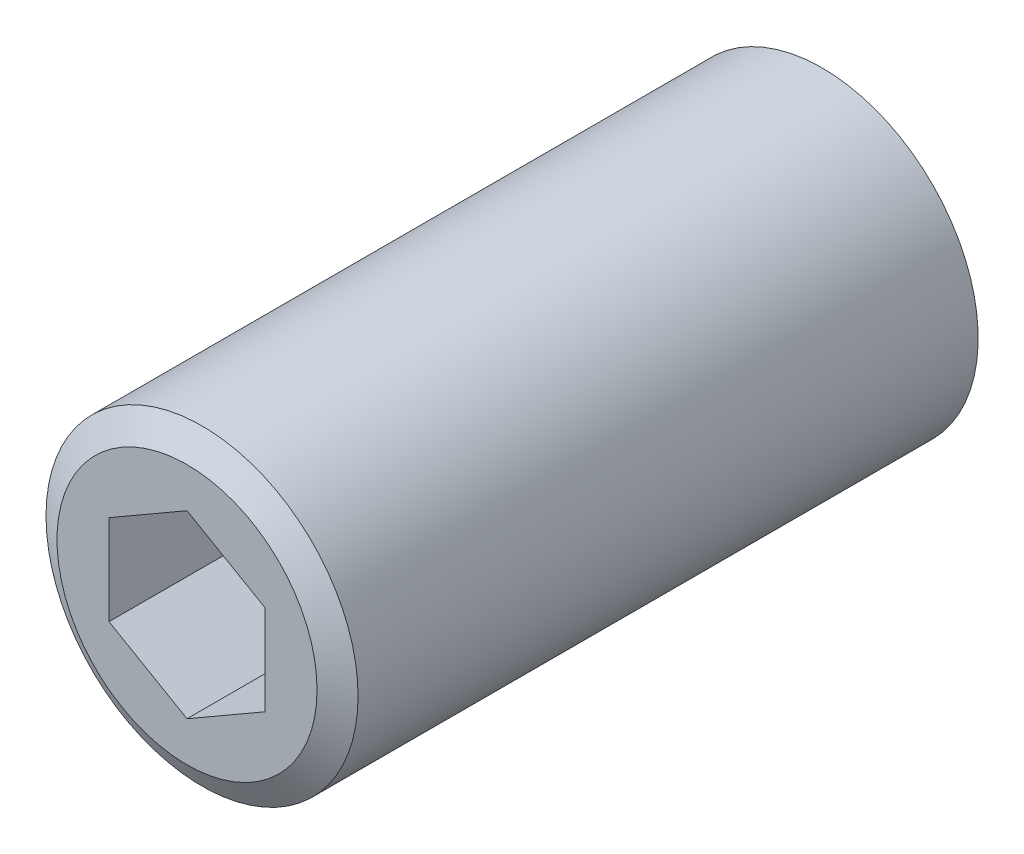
ISO-10303-21;
HEADER;
FILE_DESCRIPTION(('STEP AP214'),'2;1');
FILE_NAME('part.step','',(''),(''),'','','');
FILE_SCHEMA(('AUTOMOTIVE_DESIGN { 1 0 10303 214 1 1 1 1 }'));
ENDSEC;
DATA;
#1=APPLICATION_CONTEXT('core data for automotive mechanical design processes');
#2=APPLICATION_PROTOCOL_DEFINITION('international standard','automotive_design',2000,#1);
#3=PRODUCT_CONTEXT('',#1,'mechanical');
#4=PRODUCT('Part','Part','',(#3));
#5=PRODUCT_RELATED_PRODUCT_CATEGORY('part','',(#4));
#6=PRODUCT_DEFINITION_FORMATION('','',#4);
#7=PRODUCT_DEFINITION_CONTEXT('part definition',#1,'design');
#8=PRODUCT_DEFINITION('design','',#6,#7);
#9=PRODUCT_DEFINITION_SHAPE('','',#8);
#10=(LENGTH_UNIT() NAMED_UNIT(*) SI_UNIT(.MILLI.,.METRE.));
#11=(NAMED_UNIT(*) PLANE_ANGLE_UNIT() SI_UNIT($,.RADIAN.));
#12=(NAMED_UNIT(*) SI_UNIT($,.STERADIAN.) SOLID_ANGLE_UNIT());
#13=UNCERTAINTY_MEASURE_WITH_UNIT(LENGTH_MEASURE(1.E-05),#10,'distance_accuracy_value','');
#14=(GEOMETRIC_REPRESENTATION_CONTEXT(3) GLOBAL_UNCERTAINTY_ASSIGNED_CONTEXT((#13)) GLOBAL_UNIT_ASSIGNED_CONTEXT((#10,
#11,#12)) REPRESENTATION_CONTEXT('',''));
#15=CARTESIAN_POINT('',(0.,0.,0.));
#16=DIRECTION('',(0.,0.,1.));
#17=DIRECTION('',(1.,0.,0.));
#18=AXIS2_PLACEMENT_3D('',#15,#16,#17);
#19=CARTESIAN_POINT('',(-2.3,-5.,0.));
#20=DIRECTION('',(0.707106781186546,0.,0.707106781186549));
#21=DIRECTION('',(0.707106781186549,0.,-0.707106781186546));
#22=AXIS2_PLACEMENT_3D('',#19,#20,#21);
#23=PLANE('',#22);
#24=DIRECTION('',(0.577350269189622,-0.577350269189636,-0.57735026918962));
#25=VECTOR('',#24,1.);
#26=CARTESIAN_POINT('',(-1.4,-3.20000000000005,-0.9));
#27=LINE('',#26,#25);
#28=CARTESIAN_POINT('',(-3.45,-1.14999999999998,1.15));
#29=VERTEX_POINT('',#28);
#30=CARTESIAN_POINT('',(-2.3,-2.29999999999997,0.));
#31=VERTEX_POINT('',#30);
#32=EDGE_CURVE('E375',#29,#31,#27,.T.);
#33=ORIENTED_EDGE('',*,*,#32,.T.);
#34=DIRECTION('',(-0.57735026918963,-0.57735026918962,0.577350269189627));
#35=VECTOR('',#34,1.);
#36=CARTESIAN_POINT('',(-3.2,-3.19999999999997,0.9));
#37=LINE('',#36,#35);
#38=CARTESIAN_POINT('',(-2.79307178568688,-2.79307178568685,0.49307178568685));
#39=VERTEX_POINT('',#38);
#40=EDGE_CURVE('E355',#31,#39,#37,.T.);
#41=ORIENTED_EDGE('',*,*,#40,.T.);
#42=CARTESIAN_POINT('',(0.,0.,-2.3));
#43=DIRECTION('',(0.707106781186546,0.,0.707106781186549));
#44=DIRECTION('',(-0.707106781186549,0.,0.707106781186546));
#45=AXIS2_PLACEMENT_3D('',#42,#43,#44);
#46=ELLIPSE('',#45,5.58614357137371,3.95);
#47=CARTESIAN_POINT('',(-3.45,-1.92353840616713,1.15));
#48=VERTEX_POINT('',#47);
#49=EDGE_CURVE('E433',#48,#39,#46,.T.);
#50=ORIENTED_EDGE('',*,*,#49,.F.);
#51=DIRECTION('',(0.,1.,0.));
#52=VECTOR('',#51,1.);
#53=CARTESIAN_POINT('',(-3.45,-5.,1.15));
#54=LINE('',#53,#52);
#55=EDGE_CURVE('E404',#48,#29,#54,.T.);
#56=ORIENTED_EDGE('',*,*,#55,.T.);
#57=EDGE_LOOP('',(#33,#41,#50,#56));
#58=FACE_BOUND('',#57,.T.);
#59=ADVANCED_FACE('F15',(#58),#23,.F.);
#60=CARTESIAN_POINT('',(-2.79307178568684,2.79307178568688,0.49307178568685));
#61=VERTEX_POINT('',#60);
#62=CARTESIAN_POINT('',(-3.45,1.92353840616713,1.15));
#63=VERTEX_POINT('',#62);
#64=EDGE_CURVE('E438',#61,#63,#46,.T.);
#65=ORIENTED_EDGE('',*,*,#64,.F.);
#66=DIRECTION('',(0.577350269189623,-0.577350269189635,-0.57735026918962));
#67=VECTOR('',#66,1.);
#68=CARTESIAN_POINT('',(0.13333333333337,-0.133333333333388,-2.43333333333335));
#69=LINE('',#68,#67);
#70=CARTESIAN_POINT('',(-2.3,2.29999999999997,0.));
#71=VERTEX_POINT('',#70);
#72=EDGE_CURVE('E325',#61,#71,#69,.T.);
#73=ORIENTED_EDGE('',*,*,#72,.T.);
#74=DIRECTION('',(-0.577350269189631,-0.577350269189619,0.577350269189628));
#75=VECTOR('',#74,1.);
#76=CARTESIAN_POINT('',(-4.73333333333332,-0.133333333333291,2.4333333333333));
#77=LINE('',#76,#75);
#78=CARTESIAN_POINT('',(-3.45,1.15,1.15));
#79=VERTEX_POINT('',#78);
#80=EDGE_CURVE('E300',#71,#79,#77,.T.);
#81=ORIENTED_EDGE('',*,*,#80,.T.);
#82=EDGE_CURVE('E410',#79,#63,#54,.T.);
#83=ORIENTED_EDGE('',*,*,#82,.T.);
#84=EDGE_LOOP('',(#65,#73,#81,#83));
#85=FACE_BOUND('',#84,.T.);
#86=ADVANCED_FACE('F596',(#85),#23,.F.);
#87=CARTESIAN_POINT('',(2.3,-5.,0.));
#88=DIRECTION('',(-0.707106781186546,0.,0.707106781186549));
#89=DIRECTION('',(0.707106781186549,0.,0.707106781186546));
#90=AXIS2_PLACEMENT_3D('',#87,#88,#89);
#91=PLANE('',#90);
#92=CARTESIAN_POINT('',(0.,0.,-2.3));
#93=DIRECTION('',(-0.707106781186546,0.,0.707106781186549));
#94=DIRECTION('',(0.707106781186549,0.,0.707106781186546));
#95=AXIS2_PLACEMENT_3D('',#92,#93,#94);
#96=ELLIPSE('',#95,5.58614357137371,3.95);
#97=CARTESIAN_POINT('',(2.79307178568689,-2.79307178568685,0.49307178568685));
#98=VERTEX_POINT('',#97);
#99=CARTESIAN_POINT('',(3.45,-1.92353840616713,1.15));
#100=VERTEX_POINT('',#99);
#101=EDGE_CURVE('E426',#98,#100,#96,.T.);
#102=ORIENTED_EDGE('',*,*,#101,.F.);
#103=DIRECTION('',(-0.57735026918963,0.57735026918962,-0.577350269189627));
#104=VECTOR('',#103,1.);
#105=CARTESIAN_POINT('',(3.2,-3.19999999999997,0.9));
#106=LINE('',#105,#104);
#107=CARTESIAN_POINT('',(2.3,-2.3,0.));
#108=VERTEX_POINT('',#107);
#109=EDGE_CURVE('E338',#98,#108,#106,.T.);
#110=ORIENTED_EDGE('',*,*,#109,.T.);
#111=DIRECTION('',(0.577350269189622,0.577350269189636,0.57735026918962));
#112=VECTOR('',#111,1.);
#113=CARTESIAN_POINT('',(1.4,-3.20000000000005,-0.9));
#114=LINE('',#113,#112);
#115=CARTESIAN_POINT('',(3.45,-1.14999999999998,1.15));
#116=VERTEX_POINT('',#115);
#117=EDGE_CURVE('E363',#108,#116,#114,.T.);
#118=ORIENTED_EDGE('',*,*,#117,.T.);
#119=DIRECTION('',(0.,1.,0.));
#120=VECTOR('',#119,1.);
#121=CARTESIAN_POINT('',(3.45,-5.,1.15));
#122=LINE('',#121,#120);
#123=EDGE_CURVE('E411',#100,#116,#122,.T.);
#124=ORIENTED_EDGE('',*,*,#123,.F.);
#125=EDGE_LOOP('',(#102,#110,#118,#124));
#126=FACE_BOUND('',#125,.T.);
#127=ADVANCED_FACE('F635',(#126),#91,.F.);
#128=DIRECTION('',(-0.577350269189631,0.577350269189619,-0.577350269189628));
#129=VECTOR('',#128,1.);
#130=CARTESIAN_POINT('',(4.73333333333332,-0.133333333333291,2.4333333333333));
#131=LINE('',#130,#129);
#132=CARTESIAN_POINT('',(3.45,1.15000000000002,1.15));
#133=VERTEX_POINT('',#132);
#134=CARTESIAN_POINT('',(2.30000000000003,2.3,0.));
#135=VERTEX_POINT('',#134);
#136=EDGE_CURVE('E288',#133,#135,#131,.T.);
#137=ORIENTED_EDGE('',*,*,#136,.T.);
#138=DIRECTION('',(0.577350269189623,0.577350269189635,0.57735026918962));
#139=VECTOR('',#138,1.);
#140=CARTESIAN_POINT('',(-0.133333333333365,-0.133333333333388,-2.43333333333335));
#141=LINE('',#140,#139);
#142=CARTESIAN_POINT('',(2.79307178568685,2.79307178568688,0.49307178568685));
#143=VERTEX_POINT('',#142);
#144=EDGE_CURVE('E308',#135,#143,#141,.T.);
#145=ORIENTED_EDGE('',*,*,#144,.T.);
#146=CARTESIAN_POINT('',(3.45,1.92353840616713,1.15));
#147=VERTEX_POINT('',#146);
#148=EDGE_CURVE('E430',#147,#143,#96,.T.);
#149=ORIENTED_EDGE('',*,*,#148,.F.);
#150=EDGE_CURVE('E416',#133,#147,#122,.T.);
#151=ORIENTED_EDGE('',*,*,#150,.F.);
#152=EDGE_LOOP('',(#137,#145,#149,#151));
#153=FACE_BOUND('',#152,.T.);
#154=ADVANCED_FACE('F504',(#153),#91,.F.);
#155=CARTESIAN_POINT('',(0.,0.,46.27));
#156=DIRECTION('',(0.,0.,1.));
#157=DIRECTION('',(1.,0.,0.));
#158=AXIS2_PLACEMENT_3D('',#155,#156,#157);
#159=CYLINDRICAL_SURFACE('',#158,3.95);
#160=CARTESIAN_POINT('',(0.,0.,1.27));
#161=DIRECTION('',(0.,0.,1.));
#162=DIRECTION('',(1.,0.,0.));
#163=AXIS2_PLACEMENT_3D('',#160,#161,#162);
#164=CIRCLE('',#163,3.95);
#165=CARTESIAN_POINT('',(3.95,0.,1.27));
#166=VERTEX_POINT('',#165);
#167=EDGE_CURVE('E422',#166,#166,#164,.T.);
#168=ORIENTED_EDGE('',*,*,#167,.F.);
#169=EDGE_LOOP('',(#168));
#170=FACE_BOUND('',#169,.T.);
#171=CARTESIAN_POINT('',(0.,0.,1.15));
#172=DIRECTION('',(0.,0.,1.));
#173=DIRECTION('',(0.,1.,0.));
#174=AXIS2_PLACEMENT_3D('',#171,#172,#173);
#175=CIRCLE('',#174,3.95);
#176=CARTESIAN_POINT('',(-1.92353840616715,-3.45,1.15));
#177=VERTEX_POINT('',#176);
#178=CARTESIAN_POINT('',(1.92353840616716,-3.45,1.15));
#179=VERTEX_POINT('',#178);
#180=EDGE_CURVE('E331',#177,#179,#175,.T.);
#181=ORIENTED_EDGE('',*,*,#180,.T.);
#182=CARTESIAN_POINT('',(0.,0.,-2.3));
#183=DIRECTION('',(0.,0.707106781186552,0.707106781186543));
#184=DIRECTION('',(0.,-0.707106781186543,0.707106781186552));
#185=AXIS2_PLACEMENT_3D('',#182,#183,#184);
#186=ELLIPSE('',#185,5.58614357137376,3.95);
#187=EDGE_CURVE('E346',#179,#98,#186,.T.);
#188=ORIENTED_EDGE('',*,*,#187,.T.);
#189=ORIENTED_EDGE('',*,*,#101,.T.);
#190=CARTESIAN_POINT('',(0.,0.,1.15));
#191=DIRECTION('',(0.,0.,1.));
#192=DIRECTION('',(1.,0.,0.));
#193=AXIS2_PLACEMENT_3D('',#190,#191,#192);
#194=CIRCLE('',#193,3.95);
#195=EDGE_CURVE('E429',#100,#147,#194,.T.);
#196=ORIENTED_EDGE('',*,*,#195,.T.);
#197=ORIENTED_EDGE('',*,*,#148,.T.);
#198=CARTESIAN_POINT('',(0.,0.,-2.3));
#199=DIRECTION('',(0.,-0.707106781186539,0.707106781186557));
#200=DIRECTION('',(0.,0.707106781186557,0.707106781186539));
#201=AXIS2_PLACEMENT_3D('',#198,#199,#200);
#202=ELLIPSE('',#201,5.58614357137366,3.95);
#203=CARTESIAN_POINT('',(1.92353840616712,3.45,1.15));
#204=VERTEX_POINT('',#203);
#205=EDGE_CURVE('E316',#143,#204,#202,.T.);
#206=ORIENTED_EDGE('',*,*,#205,.T.);
#207=CARTESIAN_POINT('',(0.,0.,1.15));
#208=DIRECTION('',(0.,0.,1.));
#209=DIRECTION('',(0.,1.,0.));
#210=AXIS2_PLACEMENT_3D('',#207,#208,#209);
#211=CIRCLE('',#210,3.95);
#212=CARTESIAN_POINT('',(-1.92353840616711,3.45,1.15));
#213=VERTEX_POINT('',#212);
#214=EDGE_CURVE('E328',#204,#213,#211,.T.);
#215=ORIENTED_EDGE('',*,*,#214,.T.);
#216=EDGE_CURVE('E321',#213,#61,#202,.T.);
#217=ORIENTED_EDGE('',*,*,#216,.T.);
#218=ORIENTED_EDGE('',*,*,#64,.T.);
#219=CARTESIAN_POINT('',(0.,0.,1.15));
#220=DIRECTION('',(0.,0.,1.));
#221=DIRECTION('',(1.,0.,0.));
#222=AXIS2_PLACEMENT_3D('',#219,#220,#221);
#223=CIRCLE('',#222,3.95);
#224=EDGE_CURVE('E437',#63,#48,#223,.T.);
#225=ORIENTED_EDGE('',*,*,#224,.T.);
#226=ORIENTED_EDGE('',*,*,#49,.T.);
#227=EDGE_CURVE('E351',#39,#177,#186,.T.);
#228=ORIENTED_EDGE('',*,*,#227,.T.);
#229=EDGE_LOOP('',(#181,#188,#189,#196,#197,#206,#215,#217,#218,#225,#226,#228));
#230=FACE_BOUND('',#229,.T.);
#231=ADVANCED_FACE('F498',(#170,#230),#159,.T.);
#232=CARTESIAN_POINT('',(5.,0.,1.27));
#233=DIRECTION('',(0.,0.,-1.));
#234=DIRECTION('',(-1.,0.,0.));
#235=AXIS2_PLACEMENT_3D('',#232,#233,#234);
#236=PLANE('',#235);
#237=CARTESIAN_POINT('',(0.,0.,1.27));
#238=DIRECTION('',(0.,0.,-1.));
#239=DIRECTION('',(-1.,0.,0.));
#240=AXIS2_PLACEMENT_3D('',#237,#238,#239);
#241=CIRCLE('',#240,5.);
#242=CARTESIAN_POINT('',(-5.,0.,1.27));
#243=VERTEX_POINT('',#242);
#244=EDGE_CURVE('E9',#243,#243,#241,.T.);
#245=ORIENTED_EDGE('',*,*,#244,.T.);
#246=EDGE_LOOP('',(#245));
#247=FACE_BOUND('',#246,.T.);
#248=ORIENTED_EDGE('',*,*,#167,.T.);
#249=EDGE_LOOP('',(#248));
#250=FACE_BOUND('',#249,.T.);
#251=ADVANCED_FACE('F494',(#247,#250),#236,.T.);
#252=DIRECTION('',(0.577350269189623,-0.577350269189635,-0.57735026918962));
#253=VECTOR('',#252,1.);
#254=CARTESIAN_POINT('',(-0.633333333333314,-1.66666666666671,-1.6666666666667));
#255=LINE('',#254,#253);
#256=CARTESIAN_POINT('',(-2.3,0.,0.));
#257=VERTEX_POINT('',#256);
#258=EDGE_CURVE('E280',#79,#257,#255,.T.);
#259=ORIENTED_EDGE('',*,*,#258,.T.);
#260=DIRECTION('',(-0.577350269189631,-0.577350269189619,0.577350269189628));
#261=VECTOR('',#260,1.);
#262=CARTESIAN_POINT('',(-3.96666666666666,-1.66666666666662,1.66666666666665));
#263=LINE('',#262,#261);
#264=EDGE_CURVE('E394',#257,#29,#263,.T.);
#265=ORIENTED_EDGE('',*,*,#264,.T.);
#266=EDGE_CURVE('E409',#29,#79,#54,.T.);
#267=ORIENTED_EDGE('',*,*,#266,.T.);
#268=EDGE_LOOP('',(#259,#265,#267));
#269=FACE_BOUND('',#268,.T.);
#270=ADVANCED_FACE('F497',(#269),#23,.F.);
#271=CARTESIAN_POINT('',(-3.45,-5.,1.15));
#272=DIRECTION('',(0.,0.,1.));
#273=DIRECTION('',(1.,0.,0.));
#274=AXIS2_PLACEMENT_3D('',#271,#272,#273);
#275=PLANE('',#274);
#276=ORIENTED_EDGE('',*,*,#55,.F.);
#277=ORIENTED_EDGE('',*,*,#224,.F.);
#278=ORIENTED_EDGE('',*,*,#82,.F.);
#279=ORIENTED_EDGE('',*,*,#266,.F.);
#280=EDGE_LOOP('',(#276,#277,#278,#279));
#281=FACE_BOUND('',#280,.T.);
#282=ADVANCED_FACE('F603',(#281),#275,.F.);
#283=CARTESIAN_POINT('',(3.45,-5.,1.15));
#284=DIRECTION('',(0.,0.,1.));
#285=DIRECTION('',(1.,0.,0.));
#286=AXIS2_PLACEMENT_3D('',#283,#284,#285);
#287=PLANE('',#286);
#288=ORIENTED_EDGE('',*,*,#123,.T.);
#289=EDGE_CURVE('E415',#116,#133,#122,.T.);
#290=ORIENTED_EDGE('',*,*,#289,.T.);
#291=ORIENTED_EDGE('',*,*,#150,.T.);
#292=ORIENTED_EDGE('',*,*,#195,.F.);
#293=EDGE_LOOP('',(#288,#290,#291,#292));
#294=FACE_BOUND('',#293,.T.);
#295=ADVANCED_FACE('F641',(#294),#287,.F.);
#296=ORIENTED_EDGE('',*,*,#289,.F.);
#297=DIRECTION('',(-0.577350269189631,0.577350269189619,-0.577350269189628));
#298=VECTOR('',#297,1.);
#299=CARTESIAN_POINT('',(3.96666666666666,-1.66666666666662,1.66666666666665));
#300=LINE('',#299,#298);
#301=CARTESIAN_POINT('',(2.3,0.,0.));
#302=VERTEX_POINT('',#301);
#303=EDGE_CURVE('E382',#116,#302,#300,.T.);
#304=ORIENTED_EDGE('',*,*,#303,.T.);
#305=DIRECTION('',(0.577350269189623,0.577350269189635,0.57735026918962));
#306=VECTOR('',#305,1.);
#307=CARTESIAN_POINT('',(0.63333333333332,-1.66666666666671,-1.6666666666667));
#308=LINE('',#307,#306);
#309=EDGE_CURVE('E270',#302,#133,#308,.T.);
#310=ORIENTED_EDGE('',*,*,#309,.T.);
#311=EDGE_LOOP('',(#296,#304,#310));
#312=FACE_BOUND('',#311,.T.);
#313=ADVANCED_FACE('F645',(#312),#91,.F.);
#314=CARTESIAN_POINT('',(5.,2.3,0.));
#315=DIRECTION('',(0.,-0.707106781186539,0.707106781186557));
#316=DIRECTION('',(0.,0.707106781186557,0.707106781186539));
#317=AXIS2_PLACEMENT_3D('',#314,#315,#316);
#318=PLANE('',#317);
#319=DIRECTION('',(-1.,0.,0.));
#320=VECTOR('',#319,1.);
#321=CARTESIAN_POINT('',(5.,3.45,1.15));
#322=LINE('',#321,#320);
#323=CARTESIAN_POINT('',(1.14999999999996,3.45,1.15));
#324=VERTEX_POINT('',#323);
#325=CARTESIAN_POINT('',(-1.15000000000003,3.45,1.15));
#326=VERTEX_POINT('',#325);
#327=EDGE_CURVE('E260',#324,#326,#322,.T.);
#328=ORIENTED_EDGE('',*,*,#327,.F.);
#329=DIRECTION('',(0.577350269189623,0.577350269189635,0.57735026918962));
#330=VECTOR('',#329,1.);
#331=CARTESIAN_POINT('',(-2.43333333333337,-0.133333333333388,-2.43333333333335));
#332=LINE('',#331,#330);
#333=CARTESIAN_POINT('',(0.,2.3,0.));
#334=VERTEX_POINT('',#333);
#335=EDGE_CURVE('E449',#334,#324,#332,.T.);
#336=ORIENTED_EDGE('',*,*,#335,.F.);
#337=DIRECTION('',(0.577350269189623,-0.577350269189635,-0.57735026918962));
#338=VECTOR('',#337,1.);
#339=CARTESIAN_POINT('',(2.43333333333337,-0.133333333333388,-2.43333333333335));
#340=LINE('',#339,#338);
#341=EDGE_CURVE('E312',#326,#334,#340,.T.);
#342=ORIENTED_EDGE('',*,*,#341,.F.);
#343=EDGE_LOOP('',(#328,#336,#342));
#344=FACE_BOUND('',#343,.T.);
#345=ADVANCED_FACE('F651',(#344),#318,.F.);
#346=ORIENTED_EDGE('',*,*,#144,.F.);
#347=DIRECTION('',(0.577350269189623,-0.577350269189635,-0.57735026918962));
#348=VECTOR('',#347,1.);
#349=CARTESIAN_POINT('',(3.96666666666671,0.633333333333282,-1.6666666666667));
#350=LINE('',#349,#348);
#351=EDGE_CURVE('E304',#324,#135,#350,.T.);
#352=ORIENTED_EDGE('',*,*,#351,.F.);
#353=EDGE_CURVE('E255',#204,#324,#322,.T.);
#354=ORIENTED_EDGE('',*,*,#353,.F.);
#355=ORIENTED_EDGE('',*,*,#205,.F.);
#356=EDGE_LOOP('',(#346,#352,#354,#355));
#357=FACE_BOUND('',#356,.T.);
#358=ADVANCED_FACE('F579',(#357),#318,.F.);
#359=CARTESIAN_POINT('',(5.,3.45,1.15));
#360=DIRECTION('',(0.,0.,1.));
#361=DIRECTION('',(0.,1.,0.));
#362=AXIS2_PLACEMENT_3D('',#359,#360,#361);
#363=PLANE('',#362);
#364=ORIENTED_EDGE('',*,*,#353,.T.);
#365=ORIENTED_EDGE('',*,*,#327,.T.);
#366=EDGE_CURVE('E256',#326,#213,#322,.T.);
#367=ORIENTED_EDGE('',*,*,#366,.T.);
#368=ORIENTED_EDGE('',*,*,#214,.F.);
#369=EDGE_LOOP('',(#364,#365,#367,#368));
#370=FACE_BOUND('',#369,.T.);
#371=ADVANCED_FACE('F576',(#370),#363,.F.);
#372=ORIENTED_EDGE('',*,*,#366,.F.);
#373=DIRECTION('',(0.577350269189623,0.577350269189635,0.57735026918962));
#374=VECTOR('',#373,1.);
#375=CARTESIAN_POINT('',(-3.9666666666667,0.633333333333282,-1.6666666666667));
#376=LINE('',#375,#374);
#377=EDGE_CURVE('E320',#71,#326,#376,.T.);
#378=ORIENTED_EDGE('',*,*,#377,.F.);
#379=ORIENTED_EDGE('',*,*,#72,.F.);
#380=ORIENTED_EDGE('',*,*,#216,.F.);
#381=EDGE_LOOP('',(#372,#378,#379,#380));
#382=FACE_BOUND('',#381,.T.);
#383=ADVANCED_FACE('F704',(#382),#318,.F.);
#384=CARTESIAN_POINT('',(5.,-2.3,0.));
#385=DIRECTION('',(0.,0.707106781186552,0.707106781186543));
#386=DIRECTION('',(0.,0.707106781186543,-0.707106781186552));
#387=AXIS2_PLACEMENT_3D('',#384,#385,#386);
#388=PLANE('',#387);
#389=DIRECTION('',(-0.57735026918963,0.57735026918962,-0.577350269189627));
#390=VECTOR('',#389,1.);
#391=CARTESIAN_POINT('',(0.9,-3.19999999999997,0.9));
#392=LINE('',#391,#390);
#393=CARTESIAN_POINT('',(1.15000000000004,-3.45,1.15));
#394=VERTEX_POINT('',#393);
#395=CARTESIAN_POINT('',(0.,-2.3,0.));
#396=VERTEX_POINT('',#395);
#397=EDGE_CURVE('E461',#394,#396,#392,.T.);
#398=ORIENTED_EDGE('',*,*,#397,.F.);
#399=DIRECTION('',(-1.,0.,0.));
#400=VECTOR('',#399,1.);
#401=CARTESIAN_POINT('',(5.,-3.45,1.15));
#402=LINE('',#401,#400);
#403=CARTESIAN_POINT('',(-1.14999999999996,-3.45,1.15));
#404=VERTEX_POINT('',#403);
#405=EDGE_CURVE('E254',#394,#404,#402,.T.);
#406=ORIENTED_EDGE('',*,*,#405,.T.);
#407=DIRECTION('',(-0.57735026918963,-0.57735026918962,0.577350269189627));
#408=VECTOR('',#407,1.);
#409=CARTESIAN_POINT('',(-0.9,-3.19999999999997,0.9));
#410=LINE('',#409,#408);
#411=EDGE_CURVE('E342',#396,#404,#410,.T.);
#412=ORIENTED_EDGE('',*,*,#411,.F.);
#413=EDGE_LOOP('',(#398,#406,#412));
#414=FACE_BOUND('',#413,.T.);
#415=ADVANCED_FACE('F523',(#414),#388,.F.);
#416=EDGE_CURVE('E248',#179,#394,#402,.T.);
#417=ORIENTED_EDGE('',*,*,#416,.T.);
#418=DIRECTION('',(-0.57735026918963,-0.57735026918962,0.577350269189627));
#419=VECTOR('',#418,1.);
#420=CARTESIAN_POINT('',(0.633333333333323,-3.96666666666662,1.66666666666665));
#421=LINE('',#420,#419);
#422=EDGE_CURVE('E334',#108,#394,#421,.T.);
#423=ORIENTED_EDGE('',*,*,#422,.F.);
#424=ORIENTED_EDGE('',*,*,#109,.F.);
#425=ORIENTED_EDGE('',*,*,#187,.F.);
#426=EDGE_LOOP('',(#417,#423,#424,#425));
#427=FACE_BOUND('',#426,.T.);
#428=ADVANCED_FACE('F514',(#427),#388,.F.);
#429=ORIENTED_EDGE('',*,*,#40,.F.);
#430=DIRECTION('',(-0.57735026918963,0.57735026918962,-0.577350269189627));
#431=VECTOR('',#430,1.);
#432=CARTESIAN_POINT('',(-0.633333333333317,-3.96666666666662,1.66666666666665));
#433=LINE('',#432,#431);
#434=EDGE_CURVE('E350',#404,#31,#433,.T.);
#435=ORIENTED_EDGE('',*,*,#434,.F.);
#436=EDGE_CURVE('E250',#404,#177,#402,.T.);
#437=ORIENTED_EDGE('',*,*,#436,.T.);
#438=ORIENTED_EDGE('',*,*,#227,.F.);
#439=EDGE_LOOP('',(#429,#435,#437,#438));
#440=FACE_BOUND('',#439,.T.);
#441=ADVANCED_FACE('F607',(#440),#388,.F.);
#442=CARTESIAN_POINT('',(5.,-3.45,1.15));
#443=DIRECTION('',(0.,0.,1.));
#444=DIRECTION('',(0.,1.,0.));
#445=AXIS2_PLACEMENT_3D('',#442,#443,#444);
#446=PLANE('',#445);
#447=ORIENTED_EDGE('',*,*,#436,.F.);
#448=ORIENTED_EDGE('',*,*,#405,.F.);
#449=ORIENTED_EDGE('',*,*,#416,.F.);
#450=ORIENTED_EDGE('',*,*,#180,.F.);
#451=EDGE_LOOP('',(#447,#448,#449,#450));
#452=FACE_BOUND('',#451,.T.);
#453=ADVANCED_FACE('F517',(#452),#446,.F.);
#454=CARTESIAN_POINT('',(5.,0.,0.));
#455=DIRECTION('',(0.,-0.707106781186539,0.707106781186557));
#456=DIRECTION('',(0.,0.707106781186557,0.707106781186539));
#457=AXIS2_PLACEMENT_3D('',#454,#455,#456);
#458=PLANE('',#457);
#459=DIRECTION('',(0.577350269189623,-0.577350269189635,-0.57735026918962));
#460=VECTOR('',#459,1.);
#461=CARTESIAN_POINT('',(3.2,-0.900000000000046,-0.9));
#462=LINE('',#461,#460);
#463=CARTESIAN_POINT('',(1.14999999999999,1.15,1.15));
#464=VERTEX_POINT('',#463);
#465=EDGE_CURVE('E266',#464,#302,#462,.T.);
#466=ORIENTED_EDGE('',*,*,#465,.F.);
#467=DIRECTION('',(-1.,0.,0.));
#468=VECTOR('',#467,1.);
#469=CARTESIAN_POINT('',(5.,1.15,1.15));
#470=LINE('',#469,#468);
#471=EDGE_CURVE('E261',#133,#464,#470,.T.);
#472=ORIENTED_EDGE('',*,*,#471,.F.);
#473=ORIENTED_EDGE('',*,*,#309,.F.);
#474=EDGE_LOOP('',(#466,#472,#473));
#475=FACE_BOUND('',#474,.T.);
#476=ADVANCED_FACE('F701',(#475),#458,.F.);
#477=CARTESIAN_POINT('',(5.,1.15,1.15));
#478=DIRECTION('',(0.,0.707106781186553,0.707106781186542));
#479=DIRECTION('',(0.,0.707106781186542,-0.707106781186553));
#480=AXIS2_PLACEMENT_3D('',#477,#478,#479);
#481=PLANE('',#480);
#482=ORIENTED_EDGE('',*,*,#471,.T.);
#483=DIRECTION('',(-0.577350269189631,-0.577350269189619,0.577350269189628));
#484=VECTOR('',#483,1.);
#485=CARTESIAN_POINT('',(-0.9,-0.899999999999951,3.2));
#486=LINE('',#485,#484);
#487=EDGE_CURVE('E284',#135,#464,#486,.T.);
#488=ORIENTED_EDGE('',*,*,#487,.F.);
#489=ORIENTED_EDGE('',*,*,#136,.F.);
#490=EDGE_LOOP('',(#482,#488,#489));
#491=FACE_BOUND('',#490,.T.);
#492=ADVANCED_FACE('F561',(#491),#481,.F.);
#493=CARTESIAN_POINT('',(5.,-1.14999999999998,1.15));
#494=DIRECTION('',(0.,-0.707106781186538,0.707106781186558));
#495=DIRECTION('',(0.,0.707106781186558,0.707106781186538));
#496=AXIS2_PLACEMENT_3D('',#493,#494,#495);
#497=PLANE('',#496);
#498=DIRECTION('',(0.577350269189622,-0.577350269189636,-0.57735026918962));
#499=VECTOR('',#498,1.);
#500=CARTESIAN_POINT('',(2.43333333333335,-2.43333333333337,-0.13333333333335));
#501=LINE('',#500,#499);
#502=CARTESIAN_POINT('',(1.15000000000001,-1.14999999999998,1.15));
#503=VERTEX_POINT('',#502);
#504=EDGE_CURVE('E359',#503,#108,#501,.T.);
#505=ORIENTED_EDGE('',*,*,#504,.F.);
#506=DIRECTION('',(-1.,0.,0.));
#507=VECTOR('',#506,1.);
#508=CARTESIAN_POINT('',(5.,-1.14999999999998,1.15));
#509=LINE('',#508,#507);
#510=EDGE_CURVE('E249',#116,#503,#509,.T.);
#511=ORIENTED_EDGE('',*,*,#510,.F.);
#512=ORIENTED_EDGE('',*,*,#117,.F.);
#513=EDGE_LOOP('',(#505,#511,#512));
#514=FACE_BOUND('',#513,.T.);
#515=ADVANCED_FACE('F626',(#514),#497,.F.);
#516=CARTESIAN_POINT('',(5.,0.,0.));
#517=DIRECTION('',(0.,0.707106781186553,0.707106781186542));
#518=DIRECTION('',(0.,0.707106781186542,-0.707106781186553));
#519=AXIS2_PLACEMENT_3D('',#516,#517,#518);
#520=PLANE('',#519);
#521=ORIENTED_EDGE('',*,*,#510,.T.);
#522=DIRECTION('',(-0.577350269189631,-0.577350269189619,0.577350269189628));
#523=VECTOR('',#522,1.);
#524=CARTESIAN_POINT('',(-0.133333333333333,-2.43333333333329,2.4333333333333));
#525=LINE('',#524,#523);
#526=EDGE_CURVE('E378',#302,#503,#525,.T.);
#527=ORIENTED_EDGE('',*,*,#526,.F.);
#528=ORIENTED_EDGE('',*,*,#303,.F.);
#529=EDGE_LOOP('',(#521,#527,#528));
#530=FACE_BOUND('',#529,.T.);
#531=ADVANCED_FACE('F714',(#530),#520,.F.);
#532=CARTESIAN_POINT('',(-1.15000000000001,1.15,1.15));
#533=VERTEX_POINT('',#532);
#534=EDGE_CURVE('E231',#533,#79,#470,.T.);
#535=ORIENTED_EDGE('',*,*,#534,.F.);
#536=DIRECTION('',(0.577350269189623,0.577350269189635,0.57735026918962));
#537=VECTOR('',#536,1.);
#538=CARTESIAN_POINT('',(-3.2,-0.900000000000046,-0.9));
#539=LINE('',#538,#537);
#540=EDGE_CURVE('E39',#257,#533,#539,.T.);
#541=ORIENTED_EDGE('',*,*,#540,.F.);
#542=ORIENTED_EDGE('',*,*,#258,.F.);
#543=EDGE_LOOP('',(#535,#541,#542));
#544=FACE_BOUND('',#543,.T.);
#545=ADVANCED_FACE('F711',(#544),#458,.F.);
#546=DIRECTION('',(-0.577350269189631,0.577350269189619,-0.577350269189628));
#547=VECTOR('',#546,1.);
#548=CARTESIAN_POINT('',(0.9,-0.899999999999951,3.2));
#549=LINE('',#548,#547);
#550=EDGE_CURVE('E296',#533,#71,#549,.T.);
#551=ORIENTED_EDGE('',*,*,#550,.F.);
#552=ORIENTED_EDGE('',*,*,#534,.T.);
#553=ORIENTED_EDGE('',*,*,#80,.F.);
#554=EDGE_LOOP('',(#551,#552,#553));
#555=FACE_BOUND('',#554,.T.);
#556=ADVANCED_FACE('F708',(#555),#481,.F.);
#557=DIRECTION('',(-0.577350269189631,0.577350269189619,-0.577350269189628));
#558=VECTOR('',#557,1.);
#559=CARTESIAN_POINT('',(0.133333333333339,-2.43333333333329,2.4333333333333));
#560=LINE('',#559,#558);
#561=CARTESIAN_POINT('',(-1.15,-1.14999999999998,1.15));
#562=VERTEX_POINT('',#561);
#563=EDGE_CURVE('E390',#562,#257,#560,.T.);
#564=ORIENTED_EDGE('',*,*,#563,.F.);
#565=EDGE_CURVE('E243',#562,#29,#509,.T.);
#566=ORIENTED_EDGE('',*,*,#565,.T.);
#567=ORIENTED_EDGE('',*,*,#264,.F.);
#568=EDGE_LOOP('',(#564,#566,#567));
#569=FACE_BOUND('',#568,.T.);
#570=ADVANCED_FACE('F613',(#569),#520,.F.);
#571=ORIENTED_EDGE('',*,*,#565,.F.);
#572=DIRECTION('',(0.577350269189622,0.577350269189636,0.57735026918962));
#573=VECTOR('',#572,1.);
#574=CARTESIAN_POINT('',(-2.43333333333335,-2.43333333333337,-0.13333333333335));
#575=LINE('',#574,#573);
#576=EDGE_CURVE('E371',#31,#562,#575,.T.);
#577=ORIENTED_EDGE('',*,*,#576,.F.);
#578=ORIENTED_EDGE('',*,*,#32,.F.);
#579=EDGE_LOOP('',(#571,#577,#578));
#580=FACE_BOUND('',#579,.T.);
#581=ADVANCED_FACE('F610',(#580),#497,.F.);
#582=CARTESIAN_POINT('',(-1.15,-5.,1.15));
#583=DIRECTION('',(-0.707106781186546,0.,0.707106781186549));
#584=DIRECTION('',(0.707106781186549,0.,0.707106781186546));
#585=AXIS2_PLACEMENT_3D('',#582,#583,#584);
#586=PLANE('',#585);
#587=DIRECTION('',(0.,1.,0.));
#588=VECTOR('',#587,1.);
#589=CARTESIAN_POINT('',(-1.15,-5.,1.15));
#590=LINE('',#589,#588);
#591=EDGE_CURVE('E403',#562,#533,#590,.T.);
#592=ORIENTED_EDGE('',*,*,#591,.F.);
#593=ORIENTED_EDGE('',*,*,#563,.T.);
#594=ORIENTED_EDGE('',*,*,#540,.T.);
#595=EDGE_LOOP('',(#592,#593,#594));
#596=FACE_BOUND('',#595,.T.);
#597=ADVANCED_FACE('F615',(#596),#586,.F.);
#598=CARTESIAN_POINT('',(0.,-5.,0.));
#599=DIRECTION('',(0.707106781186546,0.,0.707106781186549));
#600=DIRECTION('',(0.707106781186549,0.,-0.707106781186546));
#601=AXIS2_PLACEMENT_3D('',#598,#599,#600);
#602=PLANE('',#601);
#603=DIRECTION('',(0.577350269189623,-0.577350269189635,-0.57735026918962));
#604=VECTOR('',#603,1.);
#605=CARTESIAN_POINT('',(1.66666666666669,-1.66666666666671,-1.6666666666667));
#606=LINE('',#605,#604);
#607=CARTESIAN_POINT('',(0.,0.,0.));
#608=VERTEX_POINT('',#607);
#609=EDGE_CURVE('E274',#533,#608,#606,.T.);
#610=ORIENTED_EDGE('',*,*,#609,.T.);
#611=DIRECTION('',(-0.577350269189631,-0.577350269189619,0.577350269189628));
#612=VECTOR('',#611,1.);
#613=CARTESIAN_POINT('',(-1.66666666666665,-1.66666666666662,1.66666666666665));
#614=LINE('',#613,#612);
#615=EDGE_CURVE('E386',#608,#562,#614,.T.);
#616=ORIENTED_EDGE('',*,*,#615,.T.);
#617=ORIENTED_EDGE('',*,*,#591,.T.);
#618=EDGE_LOOP('',(#610,#616,#617));
#619=FACE_BOUND('',#618,.T.);
#620=ADVANCED_FACE('F538',(#619),#602,.F.);
#621=ORIENTED_EDGE('',*,*,#550,.T.);
#622=ORIENTED_EDGE('',*,*,#377,.T.);
#623=EDGE_CURVE('E399',#533,#326,#590,.T.);
#624=ORIENTED_EDGE('',*,*,#623,.F.);
#625=EDGE_LOOP('',(#621,#622,#624));
#626=FACE_BOUND('',#625,.T.);
#627=ADVANCED_FACE('F541',(#626),#586,.F.);
#628=ORIENTED_EDGE('',*,*,#623,.T.);
#629=ORIENTED_EDGE('',*,*,#341,.T.);
#630=DIRECTION('',(-0.577350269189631,-0.577350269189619,0.577350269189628));
#631=VECTOR('',#630,1.);
#632=CARTESIAN_POINT('',(-2.43333333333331,-0.133333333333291,2.4333333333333));
#633=LINE('',#632,#631);
#634=EDGE_CURVE('E292',#334,#533,#633,.T.);
#635=ORIENTED_EDGE('',*,*,#634,.T.);
#636=EDGE_LOOP('',(#628,#629,#635));
#637=FACE_BOUND('',#636,.T.);
#638=ADVANCED_FACE('F546',(#637),#602,.F.);
#639=EDGE_CURVE('E405',#404,#562,#590,.T.);
#640=ORIENTED_EDGE('',*,*,#639,.F.);
#641=ORIENTED_EDGE('',*,*,#434,.T.);
#642=ORIENTED_EDGE('',*,*,#576,.T.);
#643=EDGE_LOOP('',(#640,#641,#642));
#644=FACE_BOUND('',#643,.T.);
#645=ADVANCED_FACE('F530',(#644),#586,.F.);
#646=DIRECTION('',(0.577350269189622,-0.577350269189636,-0.57735026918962));
#647=VECTOR('',#646,1.);
#648=CARTESIAN_POINT('',(0.9,-3.20000000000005,-0.9));
#649=LINE('',#648,#647);
#650=EDGE_CURVE('E367',#562,#396,#649,.T.);
#651=ORIENTED_EDGE('',*,*,#650,.T.);
#652=ORIENTED_EDGE('',*,*,#411,.T.);
#653=ORIENTED_EDGE('',*,*,#639,.T.);
#654=EDGE_LOOP('',(#651,#652,#653));
#655=FACE_BOUND('',#654,.T.);
#656=ADVANCED_FACE('F527',(#655),#602,.F.);
#657=CARTESIAN_POINT('',(0.,-5.,0.));
#658=DIRECTION('',(-0.707106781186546,0.,0.707106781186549));
#659=DIRECTION('',(0.707106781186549,0.,0.707106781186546));
#660=AXIS2_PLACEMENT_3D('',#657,#658,#659);
#661=PLANE('',#660);
#662=DIRECTION('',(0.,1.,0.));
#663=VECTOR('',#662,1.);
#664=CARTESIAN_POINT('',(1.15,-5.,1.15));
#665=LINE('',#664,#663);
#666=EDGE_CURVE('E420',#503,#464,#665,.T.);
#667=ORIENTED_EDGE('',*,*,#666,.F.);
#668=DIRECTION('',(-0.577350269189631,0.577350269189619,-0.577350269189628));
#669=VECTOR('',#668,1.);
#670=CARTESIAN_POINT('',(1.66666666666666,-1.66666666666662,1.66666666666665));
#671=LINE('',#670,#669);
#672=EDGE_CURVE('E453',#503,#608,#671,.T.);
#673=ORIENTED_EDGE('',*,*,#672,.T.);
#674=DIRECTION('',(0.577350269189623,0.577350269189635,0.57735026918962));
#675=VECTOR('',#674,1.);
#676=CARTESIAN_POINT('',(-1.66666666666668,-1.66666666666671,-1.6666666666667));
#677=LINE('',#676,#675);
#678=EDGE_CURVE('E441',#608,#464,#677,.T.);
#679=ORIENTED_EDGE('',*,*,#678,.T.);
#680=EDGE_LOOP('',(#667,#673,#679));
#681=FACE_BOUND('',#680,.T.);
#682=ADVANCED_FACE('F656',(#681),#661,.F.);
#683=CARTESIAN_POINT('',(1.15,-5.,1.15));
#684=DIRECTION('',(0.707106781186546,0.,0.707106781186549));
#685=DIRECTION('',(0.707106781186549,0.,-0.707106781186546));
#686=AXIS2_PLACEMENT_3D('',#683,#684,#685);
#687=PLANE('',#686);
#688=ORIENTED_EDGE('',*,*,#465,.T.);
#689=ORIENTED_EDGE('',*,*,#526,.T.);
#690=ORIENTED_EDGE('',*,*,#666,.T.);
#691=EDGE_LOOP('',(#688,#689,#690));
#692=FACE_BOUND('',#691,.T.);
#693=ADVANCED_FACE('F653',(#692),#687,.F.);
#694=EDGE_CURVE('E265',#464,#533,#470,.T.);
#695=ORIENTED_EDGE('',*,*,#694,.F.);
#696=ORIENTED_EDGE('',*,*,#678,.F.);
#697=ORIENTED_EDGE('',*,*,#609,.F.);
#698=EDGE_LOOP('',(#695,#696,#697));
#699=FACE_BOUND('',#698,.T.);
#700=ADVANCED_FACE('F566',(#699),#458,.F.);
#701=DIRECTION('',(-0.577350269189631,0.577350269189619,-0.577350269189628));
#702=VECTOR('',#701,1.);
#703=CARTESIAN_POINT('',(2.43333333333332,-0.133333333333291,2.4333333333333));
#704=LINE('',#703,#702);
#705=EDGE_CURVE('E445',#464,#334,#704,.T.);
#706=ORIENTED_EDGE('',*,*,#705,.F.);
#707=ORIENTED_EDGE('',*,*,#694,.T.);
#708=ORIENTED_EDGE('',*,*,#634,.F.);
#709=EDGE_LOOP('',(#706,#707,#708));
#710=FACE_BOUND('',#709,.T.);
#711=ADVANCED_FACE('F550',(#710),#481,.F.);
#712=ORIENTED_EDGE('',*,*,#705,.T.);
#713=ORIENTED_EDGE('',*,*,#335,.T.);
#714=EDGE_CURVE('E398',#464,#324,#665,.T.);
#715=ORIENTED_EDGE('',*,*,#714,.F.);
#716=EDGE_LOOP('',(#712,#713,#715));
#717=FACE_BOUND('',#716,.T.);
#718=ADVANCED_FACE('F554',(#717),#661,.F.);
#719=ORIENTED_EDGE('',*,*,#714,.T.);
#720=ORIENTED_EDGE('',*,*,#351,.T.);
#721=ORIENTED_EDGE('',*,*,#487,.T.);
#722=EDGE_LOOP('',(#719,#720,#721));
#723=FACE_BOUND('',#722,.T.);
#724=ADVANCED_FACE('F557',(#723),#687,.F.);
#725=EDGE_CURVE('E421',#394,#503,#665,.T.);
#726=ORIENTED_EDGE('',*,*,#725,.F.);
#727=ORIENTED_EDGE('',*,*,#397,.T.);
#728=DIRECTION('',(0.577350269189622,0.577350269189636,0.57735026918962));
#729=VECTOR('',#728,1.);
#730=CARTESIAN_POINT('',(-0.9,-3.20000000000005,-0.9));
#731=LINE('',#730,#729);
#732=EDGE_CURVE('E457',#396,#503,#731,.T.);
#733=ORIENTED_EDGE('',*,*,#732,.T.);
#734=EDGE_LOOP('',(#726,#727,#733));
#735=FACE_BOUND('',#734,.T.);
#736=ADVANCED_FACE('F661',(#735),#661,.F.);
#737=ORIENTED_EDGE('',*,*,#504,.T.);
#738=ORIENTED_EDGE('',*,*,#422,.T.);
#739=ORIENTED_EDGE('',*,*,#725,.T.);
#740=EDGE_LOOP('',(#737,#738,#739));
#741=FACE_BOUND('',#740,.T.);
#742=ADVANCED_FACE('F658',(#741),#687,.F.);
#743=EDGE_CURVE('E247',#503,#562,#509,.T.);
#744=ORIENTED_EDGE('',*,*,#743,.F.);
#745=ORIENTED_EDGE('',*,*,#732,.F.);
#746=ORIENTED_EDGE('',*,*,#650,.F.);
#747=EDGE_LOOP('',(#744,#745,#746));
#748=FACE_BOUND('',#747,.T.);
#749=ADVANCED_FACE('F625',(#748),#497,.F.);
#750=ORIENTED_EDGE('',*,*,#672,.F.);
#751=ORIENTED_EDGE('',*,*,#743,.T.);
#752=ORIENTED_EDGE('',*,*,#615,.F.);
#753=EDGE_LOOP('',(#750,#751,#752));
#754=FACE_BOUND('',#753,.T.);
#755=ADVANCED_FACE('F486',(#754),#520,.F.);
#756=CARTESIAN_POINT('',(0.,0.,26.27));
#757=DIRECTION('',(0.,0.,-1.));
#758=DIRECTION('',(-1.,0.,0.));
#759=AXIS2_PLACEMENT_3D('',#756,#757,#758);
#760=CYLINDRICAL_SURFACE('',#759,6.);
#761=CARTESIAN_POINT('',(0.,0.,25.6926497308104));
#762=DIRECTION('',(0.,0.,1.));
#763=DIRECTION('',(1.,0.,0.));
#764=AXIS2_PLACEMENT_3D('',#761,#762,#763);
#765=CIRCLE('',#764,6.);
#766=CARTESIAN_POINT('',(6.,0.,25.6926497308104));
#767=VERTEX_POINT('',#766);
#768=EDGE_CURVE('E469',#767,#767,#765,.F.);
#769=ORIENTED_EDGE('',*,*,#768,.T.);
#770=EDGE_LOOP('',(#769));
#771=FACE_BOUND('',#770,.T.);
#772=CARTESIAN_POINT('',(0.,0.,1.8473502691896));
#773=DIRECTION('',(0.,0.,-1.));
#774=DIRECTION('',(-1.,0.,0.));
#775=AXIS2_PLACEMENT_3D('',#772,#773,#774);
#776=CIRCLE('',#775,6.);
#777=CARTESIAN_POINT('',(-6.,0.,1.8473502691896));
#778=VERTEX_POINT('',#777);
#779=EDGE_CURVE('E465',#778,#778,#776,.F.);
#780=ORIENTED_EDGE('',*,*,#779,.T.);
#781=EDGE_LOOP('',(#780));
#782=FACE_BOUND('',#781,.T.);
#783=ADVANCED_FACE('F483',(#771,#782),#760,.T.);
#784=CARTESIAN_POINT('',(0.,0.,26.27));
#785=DIRECTION('',(0.,0.,1.));
#786=DIRECTION('',(1.,0.,0.));
#787=AXIS2_PLACEMENT_3D('',#784,#785,#786);
#788=PLANE('',#787);
#789=DIRECTION('',(-0.866025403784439,0.5,0.));
#790=VECTOR('',#789,1.);
#791=CARTESIAN_POINT('',(3.,1.73205080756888,26.27));
#792=LINE('',#791,#790);
#793=CARTESIAN_POINT('',(3.,1.73205080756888,26.27));
#794=VERTEX_POINT('',#793);
#795=CARTESIAN_POINT('',(0.,3.46410161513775,26.27));
#796=VERTEX_POINT('',#795);
#797=EDGE_CURVE('E31',#794,#796,#792,.T.);
#798=ORIENTED_EDGE('',*,*,#797,.F.);
#799=DIRECTION('',(0.,1.,0.));
#800=VECTOR('',#799,1.);
#801=CARTESIAN_POINT('',(3.,-1.73205080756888,26.27));
#802=LINE('',#801,#800);
#803=CARTESIAN_POINT('',(3.,-1.73205080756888,26.27));
#804=VERTEX_POINT('',#803);
#805=EDGE_CURVE('E193',#804,#794,#802,.T.);
#806=ORIENTED_EDGE('',*,*,#805,.F.);
#807=DIRECTION('',(0.866025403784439,0.5,0.));
#808=VECTOR('',#807,1.);
#809=CARTESIAN_POINT('',(0.,-3.46410161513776,26.27));
#810=LINE('',#809,#808);
#811=CARTESIAN_POINT('',(0.,-3.46410161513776,26.27));
#812=VERTEX_POINT('',#811);
#813=EDGE_CURVE('E198',#812,#804,#810,.T.);
#814=ORIENTED_EDGE('',*,*,#813,.F.);
#815=DIRECTION('',(0.866025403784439,-0.5,0.));
#816=VECTOR('',#815,1.);
#817=CARTESIAN_POINT('',(-3.,-1.73205080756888,26.27));
#818=LINE('',#817,#816);
#819=CARTESIAN_POINT('',(-3.,-1.73205080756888,26.27));
#820=VERTEX_POINT('',#819);
#821=EDGE_CURVE('E221',#820,#812,#818,.T.);
#822=ORIENTED_EDGE('',*,*,#821,.F.);
#823=DIRECTION('',(0.,-1.,0.));
#824=VECTOR('',#823,1.);
#825=CARTESIAN_POINT('',(-3.,1.73205080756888,26.27));
#826=LINE('',#825,#824);
#827=CARTESIAN_POINT('',(-3.,1.73205080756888,26.27));
#828=VERTEX_POINT('',#827);
#829=EDGE_CURVE('E217',#828,#820,#826,.T.);
#830=ORIENTED_EDGE('',*,*,#829,.F.);
#831=DIRECTION('',(-0.866025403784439,-0.5,0.));
#832=VECTOR('',#831,1.);
#833=CARTESIAN_POINT('',(0.,3.46410161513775,26.27));
#834=LINE('',#833,#832);
#835=EDGE_CURVE('E214',#796,#828,#834,.T.);
#836=ORIENTED_EDGE('',*,*,#835,.F.);
#837=EDGE_LOOP('',(#798,#806,#814,#822,#830,#836));
#838=FACE_BOUND('',#837,.T.);
#839=CARTESIAN_POINT('',(0.,0.,26.27));
#840=DIRECTION('',(0.,0.,1.));
#841=DIRECTION('',(1.,0.,0.));
#842=AXIS2_PLACEMENT_3D('',#839,#840,#841);
#843=CIRCLE('',#842,5.);
#844=CARTESIAN_POINT('',(5.,0.,26.27));
#845=VERTEX_POINT('',#844);
#846=EDGE_CURVE('E24',#845,#845,#843,.T.);
#847=ORIENTED_EDGE('',*,*,#846,.T.);
#848=EDGE_LOOP('',(#847));
#849=FACE_BOUND('',#848,.T.);
#850=ADVANCED_FACE('F476',(#838,#849),#788,.T.);
#851=CARTESIAN_POINT('',(0.,0.,25.6926497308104));
#852=DIRECTION('',(0.,0.,-1.));
#853=DIRECTION('',(-1.,0.,0.));
#854=AXIS2_PLACEMENT_3D('',#851,#852,#853);
#855=CONICAL_SURFACE('',#854,6.,1.0471975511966);
#856=ORIENTED_EDGE('',*,*,#846,.F.);
#857=EDGE_LOOP('',(#856));
#858=FACE_BOUND('',#857,.T.);
#859=ORIENTED_EDGE('',*,*,#768,.F.);
#860=EDGE_LOOP('',(#859));
#861=FACE_BOUND('',#860,.T.);
#862=ADVANCED_FACE('F478',(#858,#861),#855,.T.);
#863=CARTESIAN_POINT('',(0.,0.,1.27));
#864=DIRECTION('',(0.,0.,1.));
#865=DIRECTION('',(1.,0.,0.));
#866=AXIS2_PLACEMENT_3D('',#863,#864,#865);
#867=CONICAL_SURFACE('',#866,5.,1.0471975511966);
#868=ORIENTED_EDGE('',*,*,#779,.F.);
#869=EDGE_LOOP('',(#868));
#870=FACE_BOUND('',#869,.T.);
#871=ORIENTED_EDGE('',*,*,#244,.F.);
#872=EDGE_LOOP('',(#871));
#873=FACE_BOUND('',#872,.T.);
#874=ADVANCED_FACE('F17',(#870,#873),#867,.T.);
#875=CARTESIAN_POINT('',(3.,1.73205080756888,21.27));
#876=DIRECTION('',(0.5,0.866025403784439,0.));
#877=DIRECTION('',(0.866025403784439,-0.5,0.));
#878=AXIS2_PLACEMENT_3D('',#875,#876,#877);
#879=PLANE('',#878);
#880=ORIENTED_EDGE('',*,*,#797,.T.);
#881=DIRECTION('',(0.,0.,1.));
#882=VECTOR('',#881,1.);
#883=CARTESIAN_POINT('',(0.,3.46410161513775,21.27));
#884=LINE('',#883,#882);
#885=CARTESIAN_POINT('',(0.,3.46410161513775,21.27));
#886=VERTEX_POINT('',#885);
#887=EDGE_CURVE('E167',#886,#796,#884,.T.);
#888=ORIENTED_EDGE('',*,*,#887,.F.);
#889=DIRECTION('',(-0.866025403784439,0.5,0.));
#890=VECTOR('',#889,1.);
#891=CARTESIAN_POINT('',(3.,1.73205080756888,21.27));
#892=LINE('',#891,#890);
#893=CARTESIAN_POINT('',(3.,1.73205080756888,21.27));
#894=VERTEX_POINT('',#893);
#895=EDGE_CURVE('E171',#894,#886,#892,.T.);
#896=ORIENTED_EDGE('',*,*,#895,.F.);
#897=DIRECTION('',(0.,0.,1.));
#898=VECTOR('',#897,1.);
#899=CARTESIAN_POINT('',(3.,1.73205080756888,21.27));
#900=LINE('',#899,#898);
#901=EDGE_CURVE('E228',#894,#794,#900,.T.);
#902=ORIENTED_EDGE('',*,*,#901,.T.);
#903=EDGE_LOOP('',(#880,#888,#896,#902));
#904=FACE_BOUND('',#903,.T.);
#905=ADVANCED_FACE('F169',(#904),#879,.F.);
#906=CARTESIAN_POINT('',(3.,-1.73205080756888,21.27));
#907=DIRECTION('',(1.,0.,0.));
#908=DIRECTION('',(0.,-1.,0.));
#909=AXIS2_PLACEMENT_3D('',#906,#907,#908);
#910=PLANE('',#909);
#911=ORIENTED_EDGE('',*,*,#805,.T.);
#912=ORIENTED_EDGE('',*,*,#901,.F.);
#913=DIRECTION('',(0.,1.,0.));
#914=VECTOR('',#913,1.);
#915=CARTESIAN_POINT('',(3.,-1.73205080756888,21.27));
#916=LINE('',#915,#914);
#917=CARTESIAN_POINT('',(3.,-1.73205080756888,21.27));
#918=VERTEX_POINT('',#917);
#919=EDGE_CURVE('E178',#918,#894,#916,.T.);
#920=ORIENTED_EDGE('',*,*,#919,.F.);
#921=DIRECTION('',(0.,0.,1.));
#922=VECTOR('',#921,1.);
#923=CARTESIAN_POINT('',(3.,-1.73205080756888,21.27));
#924=LINE('',#923,#922);
#925=EDGE_CURVE('E232',#918,#804,#924,.T.);
#926=ORIENTED_EDGE('',*,*,#925,.T.);
#927=EDGE_LOOP('',(#911,#912,#920,#926));
#928=FACE_BOUND('',#927,.T.);
#929=ADVANCED_FACE('F680',(#928),#910,.F.);
#930=CARTESIAN_POINT('',(0.,-3.46410161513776,21.27));
#931=DIRECTION('',(0.5,-0.866025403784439,0.));
#932=DIRECTION('',(-0.866025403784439,-0.5,0.));
#933=AXIS2_PLACEMENT_3D('',#930,#931,#932);
#934=PLANE('',#933);
#935=ORIENTED_EDGE('',*,*,#813,.T.);
#936=ORIENTED_EDGE('',*,*,#925,.F.);
#937=DIRECTION('',(0.866025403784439,0.5,0.));
#938=VECTOR('',#937,1.);
#939=CARTESIAN_POINT('',(0.,-3.46410161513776,21.27));
#940=LINE('',#939,#938);
#941=CARTESIAN_POINT('',(0.,-3.46410161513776,21.27));
#942=VERTEX_POINT('',#941);
#943=EDGE_CURVE('E207',#942,#918,#940,.T.);
#944=ORIENTED_EDGE('',*,*,#943,.F.);
#945=DIRECTION('',(0.,0.,1.));
#946=VECTOR('',#945,1.);
#947=CARTESIAN_POINT('',(0.,-3.46410161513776,21.27));
#948=LINE('',#947,#946);
#949=EDGE_CURVE('E235',#942,#812,#948,.T.);
#950=ORIENTED_EDGE('',*,*,#949,.T.);
#951=EDGE_LOOP('',(#935,#936,#944,#950));
#952=FACE_BOUND('',#951,.T.);
#953=ADVANCED_FACE('F678',(#952),#934,.F.);
#954=CARTESIAN_POINT('',(-3.,-1.73205080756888,21.27));
#955=DIRECTION('',(-0.5,-0.866025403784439,0.));
#956=DIRECTION('',(-0.866025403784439,0.5,0.));
#957=AXIS2_PLACEMENT_3D('',#954,#955,#956);
#958=PLANE('',#957);
#959=ORIENTED_EDGE('',*,*,#821,.T.);
#960=ORIENTED_EDGE('',*,*,#949,.F.);
#961=DIRECTION('',(0.866025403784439,-0.5,0.));
#962=VECTOR('',#961,1.);
#963=CARTESIAN_POINT('',(-3.,-1.73205080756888,21.27));
#964=LINE('',#963,#962);
#965=CARTESIAN_POINT('',(-3.,-1.73205080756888,21.27));
#966=VERTEX_POINT('',#965);
#967=EDGE_CURVE('E203',#966,#942,#964,.T.);
#968=ORIENTED_EDGE('',*,*,#967,.F.);
#969=DIRECTION('',(0.,0.,1.));
#970=VECTOR('',#969,1.);
#971=CARTESIAN_POINT('',(-3.,-1.73205080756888,21.27));
#972=LINE('',#971,#970);
#973=EDGE_CURVE('E238',#966,#820,#972,.T.);
#974=ORIENTED_EDGE('',*,*,#973,.T.);
#975=EDGE_LOOP('',(#959,#960,#968,#974));
#976=FACE_BOUND('',#975,.T.);
#977=ADVANCED_FACE('F676',(#976),#958,.F.);
#978=CARTESIAN_POINT('',(-3.,1.73205080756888,21.27));
#979=DIRECTION('',(-1.,0.,0.));
#980=DIRECTION('',(0.,1.,0.));
#981=AXIS2_PLACEMENT_3D('',#978,#979,#980);
#982=PLANE('',#981);
#983=ORIENTED_EDGE('',*,*,#829,.T.);
#984=ORIENTED_EDGE('',*,*,#973,.F.);
#985=DIRECTION('',(0.,-1.,0.));
#986=VECTOR('',#985,1.);
#987=CARTESIAN_POINT('',(-3.,1.73205080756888,21.27));
#988=LINE('',#987,#986);
#989=CARTESIAN_POINT('',(-3.,1.73205080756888,21.27));
#990=VERTEX_POINT('',#989);
#991=EDGE_CURVE('E187',#990,#966,#988,.T.);
#992=ORIENTED_EDGE('',*,*,#991,.F.);
#993=DIRECTION('',(0.,0.,1.));
#994=VECTOR('',#993,1.);
#995=CARTESIAN_POINT('',(-3.,1.73205080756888,21.27));
#996=LINE('',#995,#994);
#997=EDGE_CURVE('E177',#990,#828,#996,.T.);
#998=ORIENTED_EDGE('',*,*,#997,.T.);
#999=EDGE_LOOP('',(#983,#984,#992,#998));
#1000=FACE_BOUND('',#999,.T.);
#1001=ADVANCED_FACE('F672',(#1000),#982,.F.);
#1002=CARTESIAN_POINT('',(0.,3.46410161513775,21.27));
#1003=DIRECTION('',(-0.5,0.866025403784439,0.));
#1004=DIRECTION('',(0.866025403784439,0.5,0.));
#1005=AXIS2_PLACEMENT_3D('',#1002,#1003,#1004);
#1006=PLANE('',#1005);
#1007=ORIENTED_EDGE('',*,*,#835,.T.);
#1008=ORIENTED_EDGE('',*,*,#997,.F.);
#1009=DIRECTION('',(-0.866025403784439,-0.5,0.));
#1010=VECTOR('',#1009,1.);
#1011=CARTESIAN_POINT('',(0.,3.46410161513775,21.27));
#1012=LINE('',#1011,#1010);
#1013=EDGE_CURVE('E181',#886,#990,#1012,.T.);
#1014=ORIENTED_EDGE('',*,*,#1013,.F.);
#1015=ORIENTED_EDGE('',*,*,#887,.T.);
#1016=EDGE_LOOP('',(#1007,#1008,#1014,#1015));
#1017=FACE_BOUND('',#1016,.T.);
#1018=ADVANCED_FACE('F182',(#1017),#1006,.F.);
#1019=CARTESIAN_POINT('',(0.,3.46410161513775,21.27));
#1020=DIRECTION('',(0.,0.,1.));
#1021=DIRECTION('',(1.,0.,0.));
#1022=AXIS2_PLACEMENT_3D('',#1019,#1020,#1021);
#1023=PLANE('',#1022);
#1024=ORIENTED_EDGE('',*,*,#895,.T.);
#1025=ORIENTED_EDGE('',*,*,#1013,.T.);
#1026=ORIENTED_EDGE('',*,*,#991,.T.);
#1027=ORIENTED_EDGE('',*,*,#967,.T.);
#1028=ORIENTED_EDGE('',*,*,#943,.T.);
#1029=ORIENTED_EDGE('',*,*,#919,.T.);
#1030=EDGE_LOOP('',(#1024,#1025,#1026,#1027,#1028,#1029));
#1031=FACE_BOUND('',#1030,.T.);
#1032=ADVANCED_FACE('F189',(#1031),#1023,.T.);
#1033=CLOSED_SHELL('',(#59,#86,#127,#154,#231,#251,#270,#282,#295,#313,#345,#358,#371,#383,#415,
#428,#441,#453,#476,#492,#515,#531,#545,#556,#570,#581,#597,#620,#627,#638,#645,#656,#682,#693,
#700,#711,#718,#724,#736,#742,#749,#755,#783,#850,#862,#874,#905,#929,#953,#977,#1001,#1018,#1032));
#1034=MANIFOLD_SOLID_BREP('B1',#1033);
#1035=ADVANCED_BREP_SHAPE_REPRESENTATION('',(#18,#1034),#14);
#1036=SHAPE_DEFINITION_REPRESENTATION(#9,#1035);
ENDSEC;
END-ISO-10303-21;
